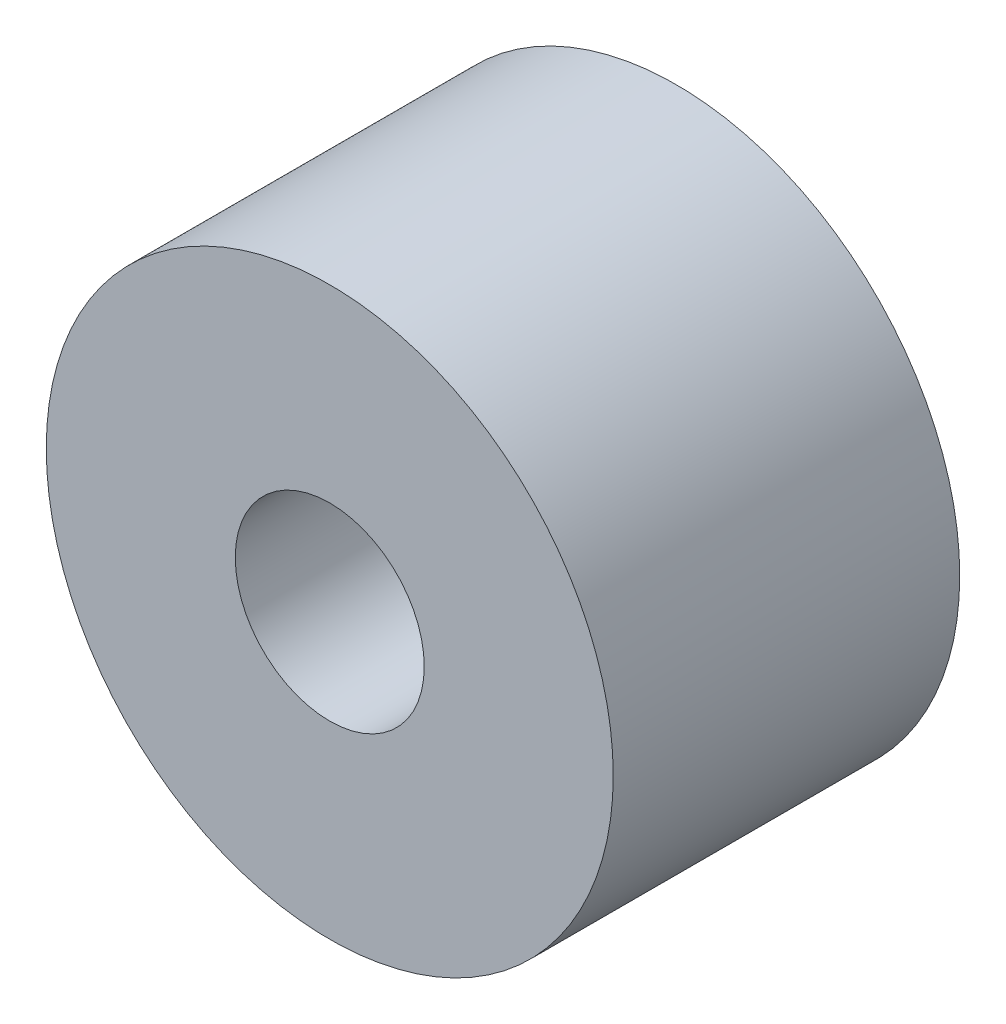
ISO-10303-21;
HEADER;
FILE_DESCRIPTION(('STEP AP214'),'2;1');
FILE_NAME('part.step','',(''),(''),'','','');
FILE_SCHEMA(('AUTOMOTIVE_DESIGN { 1 0 10303 214 1 1 1 1 }'));
ENDSEC;
DATA;
#1=APPLICATION_CONTEXT('core data for automotive mechanical design processes');
#2=APPLICATION_PROTOCOL_DEFINITION('international standard','automotive_design',2000,#1);
#3=PRODUCT_CONTEXT('',#1,'mechanical');
#4=PRODUCT('Part','Part','',(#3));
#5=PRODUCT_RELATED_PRODUCT_CATEGORY('part','',(#4));
#6=PRODUCT_DEFINITION_FORMATION('','',#4);
#7=PRODUCT_DEFINITION_CONTEXT('part definition',#1,'design');
#8=PRODUCT_DEFINITION('design','',#6,#7);
#9=PRODUCT_DEFINITION_SHAPE('','',#8);
#10=(LENGTH_UNIT() NAMED_UNIT(*) SI_UNIT(.MILLI.,.METRE.));
#11=(NAMED_UNIT(*) PLANE_ANGLE_UNIT() SI_UNIT($,.RADIAN.));
#12=(NAMED_UNIT(*) SI_UNIT($,.STERADIAN.) SOLID_ANGLE_UNIT());
#13=UNCERTAINTY_MEASURE_WITH_UNIT(LENGTH_MEASURE(1.E-05),#10,'distance_accuracy_value','');
#14=(GEOMETRIC_REPRESENTATION_CONTEXT(3) GLOBAL_UNCERTAINTY_ASSIGNED_CONTEXT((#13)) GLOBAL_UNIT_ASSIGNED_CONTEXT((#10,
#11,#12)) REPRESENTATION_CONTEXT('',''));
#15=CARTESIAN_POINT('',(0.,0.,0.));
#16=DIRECTION('',(0.,0.,1.));
#17=DIRECTION('',(1.,0.,0.));
#18=AXIS2_PLACEMENT_3D('',#15,#16,#17);
#19=CARTESIAN_POINT('',(0.,-1.5,2.5));
#20=DIRECTION('',(0.,0.,-1.));
#21=DIRECTION('',(-1.,0.,0.));
#22=AXIS2_PLACEMENT_3D('',#19,#20,#21);
#23=PLANE('',#22);
#24=CARTESIAN_POINT('',(0.,0.,2.5));
#25=DIRECTION('',(0.,0.,-1.));
#26=DIRECTION('',(-1.,0.,0.));
#27=AXIS2_PLACEMENT_3D('',#24,#25,#26);
#28=CIRCLE('',#27,4.5);
#29=CARTESIAN_POINT('',(-4.5,0.,2.5));
#30=VERTEX_POINT('',#29);
#31=EDGE_CURVE('E10',#30,#30,#28,.T.);
#32=ORIENTED_EDGE('',*,*,#31,.F.);
#33=EDGE_LOOP('',(#32));
#34=FACE_BOUND('',#33,.T.);
#35=CARTESIAN_POINT('',(0.,0.,2.5));
#36=DIRECTION('',(0.,0.,-1.));
#37=DIRECTION('',(-1.,0.,0.));
#38=AXIS2_PLACEMENT_3D('',#35,#36,#37);
#39=CIRCLE('',#38,1.5);
#40=CARTESIAN_POINT('',(-1.5,0.,2.5));
#41=VERTEX_POINT('',#40);
#42=EDGE_CURVE('E46',#41,#41,#39,.T.);
#43=ORIENTED_EDGE('',*,*,#42,.T.);
#44=EDGE_LOOP('',(#43));
#45=FACE_BOUND('',#44,.T.);
#46=ADVANCED_FACE('F32',(#34,#45),#23,.F.);
#47=CARTESIAN_POINT('',(0.,0.,0.));
#48=DIRECTION('',(0.,0.,-1.));
#49=DIRECTION('',(-1.,0.,0.));
#50=AXIS2_PLACEMENT_3D('',#47,#48,#49);
#51=CYLINDRICAL_SURFACE('',#50,4.5);
#52=CARTESIAN_POINT('',(0.,0.,-3.));
#53=DIRECTION('',(0.,0.,-1.));
#54=DIRECTION('',(-1.,0.,0.));
#55=AXIS2_PLACEMENT_3D('',#52,#53,#54);
#56=CIRCLE('',#55,4.5);
#57=CARTESIAN_POINT('',(-4.5,0.,-3.));
#58=VERTEX_POINT('',#57);
#59=EDGE_CURVE('E38',#58,#58,#56,.T.);
#60=ORIENTED_EDGE('',*,*,#59,.F.);
#61=EDGE_LOOP('',(#60));
#62=FACE_BOUND('',#61,.T.);
#63=ORIENTED_EDGE('',*,*,#31,.T.);
#64=EDGE_LOOP('',(#63));
#65=FACE_BOUND('',#64,.T.);
#66=ADVANCED_FACE('F61',(#62,#65),#51,.T.);
#67=CARTESIAN_POINT('',(0.,-1.5,-3.));
#68=DIRECTION('',(0.,0.,1.));
#69=DIRECTION('',(1.,0.,0.));
#70=AXIS2_PLACEMENT_3D('',#67,#68,#69);
#71=PLANE('',#70);
#72=CARTESIAN_POINT('',(0.,0.,-3.));
#73=DIRECTION('',(0.,0.,-1.));
#74=DIRECTION('',(-1.,0.,0.));
#75=AXIS2_PLACEMENT_3D('',#72,#73,#74);
#76=CIRCLE('',#75,1.5);
#77=CARTESIAN_POINT('',(-1.5,0.,-3.));
#78=VERTEX_POINT('',#77);
#79=EDGE_CURVE('E42',#78,#78,#76,.T.);
#80=ORIENTED_EDGE('',*,*,#79,.F.);
#81=EDGE_LOOP('',(#80));
#82=FACE_BOUND('',#81,.T.);
#83=ORIENTED_EDGE('',*,*,#59,.T.);
#84=EDGE_LOOP('',(#83));
#85=FACE_BOUND('',#84,.T.);
#86=ADVANCED_FACE('F56',(#82,#85),#71,.F.);
#87=CARTESIAN_POINT('',(0.,0.,0.));
#88=DIRECTION('',(0.,0.,-1.));
#89=DIRECTION('',(-1.,0.,0.));
#90=AXIS2_PLACEMENT_3D('',#87,#88,#89);
#91=CYLINDRICAL_SURFACE('',#90,1.5);
#92=ORIENTED_EDGE('',*,*,#42,.F.);
#93=EDGE_LOOP('',(#92));
#94=FACE_BOUND('',#93,.T.);
#95=ORIENTED_EDGE('',*,*,#79,.T.);
#96=EDGE_LOOP('',(#95));
#97=FACE_BOUND('',#96,.T.);
#98=ADVANCED_FACE('F53',(#94,#97),#91,.F.);
#99=CLOSED_SHELL('',(#46,#66,#86,#98));
#100=MANIFOLD_SOLID_BREP('B2',#99);
#101=ADVANCED_BREP_SHAPE_REPRESENTATION('',(#18,#100),#14);
#102=SHAPE_DEFINITION_REPRESENTATION(#9,#101);
ENDSEC;
END-ISO-10303-21;
